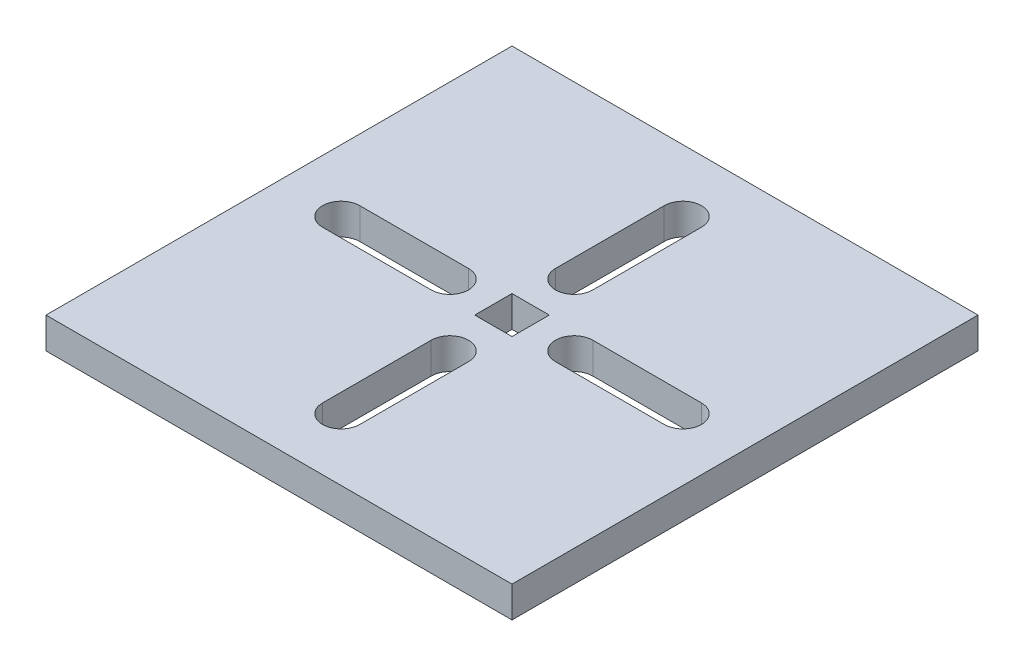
ISO-10303-21;
HEADER;
FILE_DESCRIPTION(('STEP AP214'),'2;1');
FILE_NAME('part.step','',(''),(''),'','','');
FILE_SCHEMA(('AUTOMOTIVE_DESIGN { 1 0 10303 214 1 1 1 1 }'));
ENDSEC;
DATA;
#1=APPLICATION_CONTEXT('core data for automotive mechanical design processes');
#2=APPLICATION_PROTOCOL_DEFINITION('international standard','automotive_design',2000,#1);
#3=PRODUCT_CONTEXT('',#1,'mechanical');
#4=PRODUCT('Part','Part','',(#3));
#5=PRODUCT_RELATED_PRODUCT_CATEGORY('part','',(#4));
#6=PRODUCT_DEFINITION_FORMATION('','',#4);
#7=PRODUCT_DEFINITION_CONTEXT('part definition',#1,'design');
#8=PRODUCT_DEFINITION('design','',#6,#7);
#9=PRODUCT_DEFINITION_SHAPE('','',#8);
#10=(LENGTH_UNIT() NAMED_UNIT(*) SI_UNIT(.MILLI.,.METRE.));
#11=(NAMED_UNIT(*) PLANE_ANGLE_UNIT() SI_UNIT($,.RADIAN.));
#12=(NAMED_UNIT(*) SI_UNIT($,.STERADIAN.) SOLID_ANGLE_UNIT());
#13=UNCERTAINTY_MEASURE_WITH_UNIT(LENGTH_MEASURE(1.E-05),#10,'distance_accuracy_value','');
#14=(GEOMETRIC_REPRESENTATION_CONTEXT(3) GLOBAL_UNCERTAINTY_ASSIGNED_CONTEXT((#13)) GLOBAL_UNIT_ASSIGNED_CONTEXT((#10,
#11,#12)) REPRESENTATION_CONTEXT('',''));
#15=CARTESIAN_POINT('',(0.,0.,0.));
#16=DIRECTION('',(0.,0.,1.));
#17=DIRECTION('',(1.,0.,0.));
#18=AXIS2_PLACEMENT_3D('',#15,#16,#17);
#19=CARTESIAN_POINT('',(75.0000000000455,10.,-75.0000000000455));
#20=DIRECTION('',(-1.,0.,0.));
#21=DIRECTION('',(0.,0.,1.));
#22=AXIS2_PLACEMENT_3D('',#19,#20,#21);
#23=PLANE('',#22);
#24=DIRECTION('',(0.,0.,-1.));
#25=VECTOR('',#24,1.);
#26=CARTESIAN_POINT('',(75.0000000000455,0.,-75.0000000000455));
#27=LINE('',#26,#25);
#28=CARTESIAN_POINT('',(75.0000000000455,0.,75.0000000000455));
#29=VERTEX_POINT('',#28);
#30=CARTESIAN_POINT('',(75.0000000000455,0.,-75.0000000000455));
#31=VERTEX_POINT('',#30);
#32=EDGE_CURVE('E356',#29,#31,#27,.T.);
#33=ORIENTED_EDGE('',*,*,#32,.T.);
#34=DIRECTION('',(0.,-1.,0.));
#35=VECTOR('',#34,1.);
#36=CARTESIAN_POINT('',(75.0000000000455,10.,-75.0000000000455));
#37=LINE('',#36,#35);
#38=CARTESIAN_POINT('',(75.0000000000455,10.,-75.0000000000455));
#39=VERTEX_POINT('',#38);
#40=EDGE_CURVE('E12',#39,#31,#37,.T.);
#41=ORIENTED_EDGE('',*,*,#40,.F.);
#42=DIRECTION('',(0.,0.,-1.));
#43=VECTOR('',#42,1.);
#44=CARTESIAN_POINT('',(75.0000000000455,10.,-75.0000000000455));
#45=LINE('',#44,#43);
#46=CARTESIAN_POINT('',(75.0000000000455,10.,75.0000000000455));
#47=VERTEX_POINT('',#46);
#48=EDGE_CURVE('E363',#47,#39,#45,.T.);
#49=ORIENTED_EDGE('',*,*,#48,.F.);
#50=DIRECTION('',(0.,-1.,0.));
#51=VECTOR('',#50,1.);
#52=CARTESIAN_POINT('',(75.0000000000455,10.,75.0000000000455));
#53=LINE('',#52,#51);
#54=EDGE_CURVE('E373',#47,#29,#53,.T.);
#55=ORIENTED_EDGE('',*,*,#54,.T.);
#56=EDGE_LOOP('',(#33,#41,#49,#55));
#57=FACE_BOUND('',#56,.T.);
#58=ADVANCED_FACE('F37',(#57),#23,.F.);
#59=CARTESIAN_POINT('',(-75.0000000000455,10.,-75.0000000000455));
#60=DIRECTION('',(0.,0.,1.));
#61=DIRECTION('',(1.,0.,0.));
#62=AXIS2_PLACEMENT_3D('',#59,#60,#61);
#63=PLANE('',#62);
#64=DIRECTION('',(-1.,0.,0.));
#65=VECTOR('',#64,1.);
#66=CARTESIAN_POINT('',(-75.0000000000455,0.,-75.0000000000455));
#67=LINE('',#66,#65);
#68=CARTESIAN_POINT('',(-75.0000000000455,0.,-75.0000000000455));
#69=VERTEX_POINT('',#68);
#70=EDGE_CURVE('E376',#31,#69,#67,.T.);
#71=ORIENTED_EDGE('',*,*,#70,.T.);
#72=DIRECTION('',(0.,-1.,0.));
#73=VECTOR('',#72,1.);
#74=CARTESIAN_POINT('',(-75.0000000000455,10.,-75.0000000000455));
#75=LINE('',#74,#73);
#76=CARTESIAN_POINT('',(-75.0000000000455,10.,-75.0000000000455));
#77=VERTEX_POINT('',#76);
#78=EDGE_CURVE('E44',#77,#69,#75,.T.);
#79=ORIENTED_EDGE('',*,*,#78,.F.);
#80=DIRECTION('',(-1.,0.,0.));
#81=VECTOR('',#80,1.);
#82=CARTESIAN_POINT('',(-75.0000000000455,10.,-75.0000000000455));
#83=LINE('',#82,#81);
#84=EDGE_CURVE('E366',#39,#77,#83,.T.);
#85=ORIENTED_EDGE('',*,*,#84,.F.);
#86=ORIENTED_EDGE('',*,*,#40,.T.);
#87=EDGE_LOOP('',(#71,#79,#85,#86));
#88=FACE_BOUND('',#87,.T.);
#89=ADVANCED_FACE('F409',(#88),#63,.F.);
#90=CARTESIAN_POINT('',(-75.0000000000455,10.,-75.0000000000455));
#91=DIRECTION('',(1.,0.,0.));
#92=DIRECTION('',(0.,0.,-1.));
#93=AXIS2_PLACEMENT_3D('',#90,#91,#92);
#94=PLANE('',#93);
#95=DIRECTION('',(0.,0.,1.));
#96=VECTOR('',#95,1.);
#97=CARTESIAN_POINT('',(-75.0000000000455,0.,-75.0000000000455));
#98=LINE('',#97,#96);
#99=CARTESIAN_POINT('',(-75.0000000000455,0.,75.0000000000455));
#100=VERTEX_POINT('',#99);
#101=EDGE_CURVE('E378',#69,#100,#98,.T.);
#102=ORIENTED_EDGE('',*,*,#101,.T.);
#103=DIRECTION('',(0.,-1.,0.));
#104=VECTOR('',#103,1.);
#105=CARTESIAN_POINT('',(-75.0000000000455,10.,75.0000000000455));
#106=LINE('',#105,#104);
#107=CARTESIAN_POINT('',(-75.0000000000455,10.,75.0000000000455));
#108=VERTEX_POINT('',#107);
#109=EDGE_CURVE('E383',#108,#100,#106,.T.);
#110=ORIENTED_EDGE('',*,*,#109,.F.);
#111=DIRECTION('',(0.,0.,1.));
#112=VECTOR('',#111,1.);
#113=CARTESIAN_POINT('',(-75.0000000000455,10.,-75.0000000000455));
#114=LINE('',#113,#112);
#115=EDGE_CURVE('E369',#77,#108,#114,.T.);
#116=ORIENTED_EDGE('',*,*,#115,.F.);
#117=ORIENTED_EDGE('',*,*,#78,.T.);
#118=EDGE_LOOP('',(#102,#110,#116,#117));
#119=FACE_BOUND('',#118,.T.);
#120=ADVANCED_FACE('F394',(#119),#94,.F.);
#121=CARTESIAN_POINT('',(-75.0000000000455,10.,75.0000000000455));
#122=DIRECTION('',(0.,0.,-1.));
#123=DIRECTION('',(-1.,0.,0.));
#124=AXIS2_PLACEMENT_3D('',#121,#122,#123);
#125=PLANE('',#124);
#126=DIRECTION('',(1.,0.,0.));
#127=VECTOR('',#126,1.);
#128=CARTESIAN_POINT('',(-75.0000000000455,0.,75.0000000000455));
#129=LINE('',#128,#127);
#130=EDGE_CURVE('E367',#100,#29,#129,.T.);
#131=ORIENTED_EDGE('',*,*,#130,.T.);
#132=ORIENTED_EDGE('',*,*,#54,.F.);
#133=DIRECTION('',(1.,0.,0.));
#134=VECTOR('',#133,1.);
#135=CARTESIAN_POINT('',(-75.0000000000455,10.,75.0000000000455));
#136=LINE('',#135,#134);
#137=EDGE_CURVE('E371',#108,#47,#136,.T.);
#138=ORIENTED_EDGE('',*,*,#137,.F.);
#139=ORIENTED_EDGE('',*,*,#109,.T.);
#140=EDGE_LOOP('',(#131,#132,#138,#139));
#141=FACE_BOUND('',#140,.T.);
#142=ADVANCED_FACE('F402',(#141),#125,.F.);
#143=CARTESIAN_POINT('',(0.,10.,0.));
#144=DIRECTION('',(0.,1.,0.));
#145=DIRECTION('',(0.,0.,1.));
#146=AXIS2_PLACEMENT_3D('',#143,#144,#145);
#147=PLANE('',#146);
#148=CARTESIAN_POINT('',(2.09488880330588E-13,10.,-20.));
#149=DIRECTION('',(0.,1.,0.));
#150=DIRECTION('',(1.,0.,0.));
#151=AXIS2_PLACEMENT_3D('',#148,#149,#150);
#152=CIRCLE('',#151,6.);
#153=CARTESIAN_POINT('',(-5.99999999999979,10.,-20.0000000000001));
#154=VERTEX_POINT('',#153);
#155=CARTESIAN_POINT('',(6.00000000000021,10.,-19.9999999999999));
#156=VERTEX_POINT('',#155);
#157=EDGE_CURVE('E51',#154,#156,#152,.T.);
#158=ORIENTED_EDGE('',*,*,#157,.F.);
#159=DIRECTION('',(0.,0.,1.));
#160=VECTOR('',#159,1.);
#161=CARTESIAN_POINT('',(-5.99999999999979,10.,-20.0000000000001));
#162=LINE('',#161,#160);
#163=CARTESIAN_POINT('',(-5.99999999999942,10.,-55.0000000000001));
#164=VERTEX_POINT('',#163);
#165=EDGE_CURVE('E215',#164,#154,#162,.T.);
#166=ORIENTED_EDGE('',*,*,#165,.F.);
#167=CARTESIAN_POINT('',(5.76094420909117E-13,10.,-55.));
#168=DIRECTION('',(0.,1.,0.));
#169=DIRECTION('',(1.,0.,0.));
#170=AXIS2_PLACEMENT_3D('',#167,#168,#169);
#171=CIRCLE('',#170,6.);
#172=CARTESIAN_POINT('',(6.00000000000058,10.,-54.9999999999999));
#173=VERTEX_POINT('',#172);
#174=EDGE_CURVE('E218',#173,#164,#171,.T.);
#175=ORIENTED_EDGE('',*,*,#174,.F.);
#176=DIRECTION('',(0.,0.,-1.));
#177=VECTOR('',#176,1.);
#178=CARTESIAN_POINT('',(6.00000000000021,10.,-19.9999999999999));
#179=LINE('',#178,#177);
#180=EDGE_CURVE('E224',#156,#173,#179,.T.);
#181=ORIENTED_EDGE('',*,*,#180,.F.);
#182=EDGE_LOOP('',(#158,#166,#175,#181));
#183=FACE_BOUND('',#182,.T.);
#184=CARTESIAN_POINT('',(-20.,10.,0.));
#185=DIRECTION('',(0.,1.,0.));
#186=DIRECTION('',(0.,0.,-1.));
#187=AXIS2_PLACEMENT_3D('',#184,#185,#186);
#188=CIRCLE('',#187,6.);
#189=CARTESIAN_POINT('',(-20.,10.,6.));
#190=VERTEX_POINT('',#189);
#191=CARTESIAN_POINT('',(-20.,10.,-6.));
#192=VERTEX_POINT('',#191);
#193=EDGE_CURVE('E230',#190,#192,#188,.T.);
#194=ORIENTED_EDGE('',*,*,#193,.F.);
#195=DIRECTION('',(1.,0.,0.));
#196=VECTOR('',#195,1.);
#197=CARTESIAN_POINT('',(-20.,10.,6.));
#198=LINE('',#197,#196);
#199=CARTESIAN_POINT('',(-55.,10.,6.));
#200=VERTEX_POINT('',#199);
#201=EDGE_CURVE('E238',#200,#190,#198,.T.);
#202=ORIENTED_EDGE('',*,*,#201,.F.);
#203=CARTESIAN_POINT('',(-55.,10.,0.));
#204=DIRECTION('',(0.,1.,0.));
#205=DIRECTION('',(0.,0.,-1.));
#206=AXIS2_PLACEMENT_3D('',#203,#204,#205);
#207=CIRCLE('',#206,6.);
#208=CARTESIAN_POINT('',(-55.,10.,-6.));
#209=VERTEX_POINT('',#208);
#210=EDGE_CURVE('E252',#209,#200,#207,.T.);
#211=ORIENTED_EDGE('',*,*,#210,.F.);
#212=DIRECTION('',(-1.,0.,0.));
#213=VECTOR('',#212,1.);
#214=CARTESIAN_POINT('',(-20.,10.,-6.));
#215=LINE('',#214,#213);
#216=EDGE_CURVE('E249',#192,#209,#215,.T.);
#217=ORIENTED_EDGE('',*,*,#216,.F.);
#218=EDGE_LOOP('',(#194,#202,#211,#217));
#219=FACE_BOUND('',#218,.T.);
#220=CARTESIAN_POINT('',(0.,10.,20.));
#221=DIRECTION('',(0.,1.,0.));
#222=DIRECTION('',(-1.,0.,0.));
#223=AXIS2_PLACEMENT_3D('',#220,#221,#222);
#224=CIRCLE('',#223,6.);
#225=CARTESIAN_POINT('',(5.99999999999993,10.,20.));
#226=VERTEX_POINT('',#225);
#227=CARTESIAN_POINT('',(-6.00000000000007,10.,20.));
#228=VERTEX_POINT('',#227);
#229=EDGE_CURVE('E260',#226,#228,#224,.T.);
#230=ORIENTED_EDGE('',*,*,#229,.F.);
#231=DIRECTION('',(0.,0.,-1.));
#232=VECTOR('',#231,1.);
#233=CARTESIAN_POINT('',(5.99999999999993,10.,20.));
#234=LINE('',#233,#232);
#235=CARTESIAN_POINT('',(5.99999999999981,10.,55.));
#236=VERTEX_POINT('',#235);
#237=EDGE_CURVE('E271',#236,#226,#234,.T.);
#238=ORIENTED_EDGE('',*,*,#237,.F.);
#239=CARTESIAN_POINT('',(-1.92031473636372E-13,10.,55.));
#240=DIRECTION('',(0.,1.,0.));
#241=DIRECTION('',(-1.,0.,0.));
#242=AXIS2_PLACEMENT_3D('',#239,#240,#241);
#243=CIRCLE('',#242,6.);
#244=CARTESIAN_POINT('',(-6.00000000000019,10.,55.));
#245=VERTEX_POINT('',#244);
#246=EDGE_CURVE('E285',#245,#236,#243,.T.);
#247=ORIENTED_EDGE('',*,*,#246,.F.);
#248=DIRECTION('',(0.,0.,1.));
#249=VECTOR('',#248,1.);
#250=CARTESIAN_POINT('',(-6.00000000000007,10.,20.));
#251=LINE('',#250,#249);
#252=EDGE_CURVE('E282',#228,#245,#251,.T.);
#253=ORIENTED_EDGE('',*,*,#252,.F.);
#254=EDGE_LOOP('',(#230,#238,#247,#253));
#255=FACE_BOUND('',#254,.T.);
#256=CARTESIAN_POINT('',(20.,10.,0.));
#257=DIRECTION('',(0.,1.,0.));
#258=DIRECTION('',(0.,0.,1.));
#259=AXIS2_PLACEMENT_3D('',#256,#257,#258);
#260=CIRCLE('',#259,6.);
#261=CARTESIAN_POINT('',(20.,10.,-6.));
#262=VERTEX_POINT('',#261);
#263=CARTESIAN_POINT('',(20.,10.,6.));
#264=VERTEX_POINT('',#263);
#265=EDGE_CURVE('E292',#262,#264,#260,.T.);
#266=ORIENTED_EDGE('',*,*,#265,.F.);
#267=DIRECTION('',(-1.,0.,0.));
#268=VECTOR('',#267,1.);
#269=CARTESIAN_POINT('',(20.,10.,-6.));
#270=LINE('',#269,#268);
#271=CARTESIAN_POINT('',(55.,10.,-6.));
#272=VERTEX_POINT('',#271);
#273=EDGE_CURVE('E303',#272,#262,#270,.T.);
#274=ORIENTED_EDGE('',*,*,#273,.F.);
#275=CARTESIAN_POINT('',(55.,10.,0.));
#276=DIRECTION('',(0.,1.,0.));
#277=DIRECTION('',(0.,0.,1.));
#278=AXIS2_PLACEMENT_3D('',#275,#276,#277);
#279=CIRCLE('',#278,6.);
#280=CARTESIAN_POINT('',(55.,10.,6.));
#281=VERTEX_POINT('',#280);
#282=EDGE_CURVE('E317',#281,#272,#279,.T.);
#283=ORIENTED_EDGE('',*,*,#282,.F.);
#284=DIRECTION('',(1.,0.,0.));
#285=VECTOR('',#284,1.);
#286=CARTESIAN_POINT('',(20.,10.,6.));
#287=LINE('',#286,#285);
#288=EDGE_CURVE('E314',#264,#281,#287,.T.);
#289=ORIENTED_EDGE('',*,*,#288,.F.);
#290=EDGE_LOOP('',(#266,#274,#283,#289));
#291=FACE_BOUND('',#290,.T.);
#292=DIRECTION('',(0.,0.,-1.));
#293=VECTOR('',#292,1.);
#294=CARTESIAN_POINT('',(6.,10.,-6.));
#295=LINE('',#294,#293);
#296=CARTESIAN_POINT('',(6.,10.,6.));
#297=VERTEX_POINT('',#296);
#298=CARTESIAN_POINT('',(6.,10.,-6.));
#299=VERTEX_POINT('',#298);
#300=EDGE_CURVE('E324',#297,#299,#295,.T.);
#301=ORIENTED_EDGE('',*,*,#300,.F.);
#302=DIRECTION('',(1.,0.,0.));
#303=VECTOR('',#302,1.);
#304=CARTESIAN_POINT('',(-6.,10.,6.));
#305=LINE('',#304,#303);
#306=CARTESIAN_POINT('',(-6.,10.,6.));
#307=VERTEX_POINT('',#306);
#308=EDGE_CURVE('E335',#307,#297,#305,.T.);
#309=ORIENTED_EDGE('',*,*,#308,.F.);
#310=DIRECTION('',(0.,0.,1.));
#311=VECTOR('',#310,1.);
#312=CARTESIAN_POINT('',(-6.,10.,-6.));
#313=LINE('',#312,#311);
#314=CARTESIAN_POINT('',(-6.,10.,-6.));
#315=VERTEX_POINT('',#314);
#316=EDGE_CURVE('E349',#315,#307,#313,.T.);
#317=ORIENTED_EDGE('',*,*,#316,.F.);
#318=DIRECTION('',(-1.,0.,0.));
#319=VECTOR('',#318,1.);
#320=CARTESIAN_POINT('',(-6.,10.,-6.));
#321=LINE('',#320,#319);
#322=EDGE_CURVE('E346',#299,#315,#321,.T.);
#323=ORIENTED_EDGE('',*,*,#322,.F.);
#324=EDGE_LOOP('',(#301,#309,#317,#323));
#325=FACE_BOUND('',#324,.T.);
#326=ORIENTED_EDGE('',*,*,#48,.T.);
#327=ORIENTED_EDGE('',*,*,#84,.T.);
#328=ORIENTED_EDGE('',*,*,#115,.T.);
#329=ORIENTED_EDGE('',*,*,#137,.T.);
#330=EDGE_LOOP('',(#326,#327,#328,#329));
#331=FACE_BOUND('',#330,.T.);
#332=ADVANCED_FACE('F408',(#183,#219,#255,#291,#325,#331),#147,.T.);
#333=CARTESIAN_POINT('',(0.,0.,0.));
#334=DIRECTION('',(0.,1.,0.));
#335=DIRECTION('',(0.,0.,1.));
#336=AXIS2_PLACEMENT_3D('',#333,#334,#335);
#337=PLANE('',#336);
#338=DIRECTION('',(0.,0.,1.));
#339=VECTOR('',#338,1.);
#340=CARTESIAN_POINT('',(-5.99999999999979,0.,-20.0000000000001));
#341=LINE('',#340,#339);
#342=CARTESIAN_POINT('',(-5.99999999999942,0.,-55.0000000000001));
#343=VERTEX_POINT('',#342);
#344=CARTESIAN_POINT('',(-5.99999999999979,0.,-20.0000000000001));
#345=VERTEX_POINT('',#344);
#346=EDGE_CURVE('E205',#343,#345,#341,.T.);
#347=ORIENTED_EDGE('',*,*,#346,.T.);
#348=CARTESIAN_POINT('',(2.09488880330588E-13,0.,-20.));
#349=DIRECTION('',(0.,1.,0.));
#350=DIRECTION('',(1.,0.,0.));
#351=AXIS2_PLACEMENT_3D('',#348,#349,#350);
#352=CIRCLE('',#351,6.);
#353=CARTESIAN_POINT('',(6.00000000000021,0.,-19.9999999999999));
#354=VERTEX_POINT('',#353);
#355=EDGE_CURVE('E199',#345,#354,#352,.T.);
#356=ORIENTED_EDGE('',*,*,#355,.T.);
#357=DIRECTION('',(0.,0.,-1.));
#358=VECTOR('',#357,1.);
#359=CARTESIAN_POINT('',(6.00000000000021,0.,-19.9999999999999));
#360=LINE('',#359,#358);
#361=CARTESIAN_POINT('',(6.00000000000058,0.,-54.9999999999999));
#362=VERTEX_POINT('',#361);
#363=EDGE_CURVE('E208',#354,#362,#360,.T.);
#364=ORIENTED_EDGE('',*,*,#363,.T.);
#365=CARTESIAN_POINT('',(5.76094420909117E-13,0.,-55.));
#366=DIRECTION('',(0.,1.,0.));
#367=DIRECTION('',(1.,0.,0.));
#368=AXIS2_PLACEMENT_3D('',#365,#366,#367);
#369=CIRCLE('',#368,6.);
#370=EDGE_CURVE('E59',#362,#343,#369,.T.);
#371=ORIENTED_EDGE('',*,*,#370,.T.);
#372=EDGE_LOOP('',(#347,#356,#364,#371));
#373=FACE_BOUND('',#372,.T.);
#374=DIRECTION('',(1.,0.,0.));
#375=VECTOR('',#374,1.);
#376=CARTESIAN_POINT('',(-20.,0.,6.));
#377=LINE('',#376,#375);
#378=CARTESIAN_POINT('',(-55.,0.,6.));
#379=VERTEX_POINT('',#378);
#380=CARTESIAN_POINT('',(-20.,0.,6.));
#381=VERTEX_POINT('',#380);
#382=EDGE_CURVE('E244',#379,#381,#377,.T.);
#383=ORIENTED_EDGE('',*,*,#382,.T.);
#384=CARTESIAN_POINT('',(-20.,0.,0.));
#385=DIRECTION('',(0.,1.,0.));
#386=DIRECTION('',(0.,0.,-1.));
#387=AXIS2_PLACEMENT_3D('',#384,#385,#386);
#388=CIRCLE('',#387,6.);
#389=CARTESIAN_POINT('',(-20.,0.,-6.));
#390=VERTEX_POINT('',#389);
#391=EDGE_CURVE('E234',#381,#390,#388,.T.);
#392=ORIENTED_EDGE('',*,*,#391,.T.);
#393=DIRECTION('',(-1.,0.,0.));
#394=VECTOR('',#393,1.);
#395=CARTESIAN_POINT('',(-20.,0.,-6.));
#396=LINE('',#395,#394);
#397=CARTESIAN_POINT('',(-55.,0.,-6.));
#398=VERTEX_POINT('',#397);
#399=EDGE_CURVE('E237',#390,#398,#396,.T.);
#400=ORIENTED_EDGE('',*,*,#399,.T.);
#401=CARTESIAN_POINT('',(-55.,0.,0.));
#402=DIRECTION('',(0.,1.,0.));
#403=DIRECTION('',(0.,0.,-1.));
#404=AXIS2_PLACEMENT_3D('',#401,#402,#403);
#405=CIRCLE('',#404,6.);
#406=EDGE_CURVE('E241',#398,#379,#405,.T.);
#407=ORIENTED_EDGE('',*,*,#406,.T.);
#408=EDGE_LOOP('',(#383,#392,#400,#407));
#409=FACE_BOUND('',#408,.T.);
#410=DIRECTION('',(0.,0.,-1.));
#411=VECTOR('',#410,1.);
#412=CARTESIAN_POINT('',(5.99999999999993,0.,20.));
#413=LINE('',#412,#411);
#414=CARTESIAN_POINT('',(5.99999999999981,0.,55.));
#415=VERTEX_POINT('',#414);
#416=CARTESIAN_POINT('',(5.99999999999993,0.,20.));
#417=VERTEX_POINT('',#416);
#418=EDGE_CURVE('E277',#415,#417,#413,.T.);
#419=ORIENTED_EDGE('',*,*,#418,.T.);
#420=CARTESIAN_POINT('',(0.,0.,20.));
#421=DIRECTION('',(0.,1.,0.));
#422=DIRECTION('',(-1.,0.,0.));
#423=AXIS2_PLACEMENT_3D('',#420,#421,#422);
#424=CIRCLE('',#423,6.);
#425=CARTESIAN_POINT('',(-6.00000000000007,0.,20.));
#426=VERTEX_POINT('',#425);
#427=EDGE_CURVE('E267',#417,#426,#424,.T.);
#428=ORIENTED_EDGE('',*,*,#427,.T.);
#429=DIRECTION('',(0.,0.,1.));
#430=VECTOR('',#429,1.);
#431=CARTESIAN_POINT('',(-6.00000000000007,0.,20.));
#432=LINE('',#431,#430);
#433=CARTESIAN_POINT('',(-6.00000000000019,0.,55.));
#434=VERTEX_POINT('',#433);
#435=EDGE_CURVE('E270',#426,#434,#432,.T.);
#436=ORIENTED_EDGE('',*,*,#435,.T.);
#437=CARTESIAN_POINT('',(-1.92031473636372E-13,0.,55.));
#438=DIRECTION('',(0.,1.,0.));
#439=DIRECTION('',(-1.,0.,0.));
#440=AXIS2_PLACEMENT_3D('',#437,#438,#439);
#441=CIRCLE('',#440,6.);
#442=EDGE_CURVE('E274',#434,#415,#441,.T.);
#443=ORIENTED_EDGE('',*,*,#442,.T.);
#444=EDGE_LOOP('',(#419,#428,#436,#443));
#445=FACE_BOUND('',#444,.T.);
#446=DIRECTION('',(-1.,0.,0.));
#447=VECTOR('',#446,1.);
#448=CARTESIAN_POINT('',(20.,0.,-6.));
#449=LINE('',#448,#447);
#450=CARTESIAN_POINT('',(55.,0.,-6.));
#451=VERTEX_POINT('',#450);
#452=CARTESIAN_POINT('',(20.,0.,-6.));
#453=VERTEX_POINT('',#452);
#454=EDGE_CURVE('E309',#451,#453,#449,.T.);
#455=ORIENTED_EDGE('',*,*,#454,.T.);
#456=CARTESIAN_POINT('',(20.,0.,0.));
#457=DIRECTION('',(0.,1.,0.));
#458=DIRECTION('',(0.,0.,1.));
#459=AXIS2_PLACEMENT_3D('',#456,#457,#458);
#460=CIRCLE('',#459,6.);
#461=CARTESIAN_POINT('',(20.,0.,6.));
#462=VERTEX_POINT('',#461);
#463=EDGE_CURVE('E299',#453,#462,#460,.T.);
#464=ORIENTED_EDGE('',*,*,#463,.T.);
#465=DIRECTION('',(1.,0.,0.));
#466=VECTOR('',#465,1.);
#467=CARTESIAN_POINT('',(20.,0.,6.));
#468=LINE('',#467,#466);
#469=CARTESIAN_POINT('',(55.,0.,6.));
#470=VERTEX_POINT('',#469);
#471=EDGE_CURVE('E302',#462,#470,#468,.T.);
#472=ORIENTED_EDGE('',*,*,#471,.T.);
#473=CARTESIAN_POINT('',(55.,0.,0.));
#474=DIRECTION('',(0.,1.,0.));
#475=DIRECTION('',(0.,0.,1.));
#476=AXIS2_PLACEMENT_3D('',#473,#474,#475);
#477=CIRCLE('',#476,6.);
#478=EDGE_CURVE('E306',#470,#451,#477,.T.);
#479=ORIENTED_EDGE('',*,*,#478,.T.);
#480=EDGE_LOOP('',(#455,#464,#472,#479));
#481=FACE_BOUND('',#480,.T.);
#482=DIRECTION('',(1.,0.,0.));
#483=VECTOR('',#482,1.);
#484=CARTESIAN_POINT('',(-6.,0.,6.));
#485=LINE('',#484,#483);
#486=CARTESIAN_POINT('',(-6.,0.,6.));
#487=VERTEX_POINT('',#486);
#488=CARTESIAN_POINT('',(6.,0.,6.));
#489=VERTEX_POINT('',#488);
#490=EDGE_CURVE('E341',#487,#489,#485,.T.);
#491=ORIENTED_EDGE('',*,*,#490,.T.);
#492=DIRECTION('',(0.,0.,-1.));
#493=VECTOR('',#492,1.);
#494=CARTESIAN_POINT('',(6.,0.,-6.));
#495=LINE('',#494,#493);
#496=CARTESIAN_POINT('',(6.,0.,-6.));
#497=VERTEX_POINT('',#496);
#498=EDGE_CURVE('E331',#489,#497,#495,.T.);
#499=ORIENTED_EDGE('',*,*,#498,.T.);
#500=DIRECTION('',(-1.,0.,0.));
#501=VECTOR('',#500,1.);
#502=CARTESIAN_POINT('',(-6.,0.,-6.));
#503=LINE('',#502,#501);
#504=CARTESIAN_POINT('',(-6.,0.,-6.));
#505=VERTEX_POINT('',#504);
#506=EDGE_CURVE('E334',#497,#505,#503,.T.);
#507=ORIENTED_EDGE('',*,*,#506,.T.);
#508=DIRECTION('',(0.,0.,1.));
#509=VECTOR('',#508,1.);
#510=CARTESIAN_POINT('',(-6.,0.,-6.));
#511=LINE('',#510,#509);
#512=EDGE_CURVE('E338',#505,#487,#511,.T.);
#513=ORIENTED_EDGE('',*,*,#512,.T.);
#514=EDGE_LOOP('',(#491,#499,#507,#513));
#515=FACE_BOUND('',#514,.T.);
#516=ORIENTED_EDGE('',*,*,#32,.F.);
#517=ORIENTED_EDGE('',*,*,#130,.F.);
#518=ORIENTED_EDGE('',*,*,#101,.F.);
#519=ORIENTED_EDGE('',*,*,#70,.F.);
#520=EDGE_LOOP('',(#516,#517,#518,#519));
#521=FACE_BOUND('',#520,.T.);
#522=ADVANCED_FACE('F212',(#373,#409,#445,#481,#515,#521),#337,.F.);
#523=CARTESIAN_POINT('',(6.,0.,-6.));
#524=DIRECTION('',(1.,0.,0.));
#525=DIRECTION('',(0.,0.,-1.));
#526=AXIS2_PLACEMENT_3D('',#523,#524,#525);
#527=PLANE('',#526);
#528=ORIENTED_EDGE('',*,*,#300,.T.);
#529=DIRECTION('',(0.,1.,0.));
#530=VECTOR('',#529,1.);
#531=CARTESIAN_POINT('',(6.,0.,-6.));
#532=LINE('',#531,#530);
#533=EDGE_CURVE('E344',#497,#299,#532,.T.);
#534=ORIENTED_EDGE('',*,*,#533,.F.);
#535=ORIENTED_EDGE('',*,*,#498,.F.);
#536=DIRECTION('',(0.,1.,0.));
#537=VECTOR('',#536,1.);
#538=CARTESIAN_POINT('',(6.,0.,6.));
#539=LINE('',#538,#537);
#540=EDGE_CURVE('E354',#489,#297,#539,.T.);
#541=ORIENTED_EDGE('',*,*,#540,.T.);
#542=EDGE_LOOP('',(#528,#534,#535,#541));
#543=FACE_BOUND('',#542,.T.);
#544=ADVANCED_FACE('F421',(#543),#527,.F.);
#545=CARTESIAN_POINT('',(-6.,0.,6.));
#546=DIRECTION('',(0.,0.,1.));
#547=DIRECTION('',(1.,0.,0.));
#548=AXIS2_PLACEMENT_3D('',#545,#546,#547);
#549=PLANE('',#548);
#550=ORIENTED_EDGE('',*,*,#308,.T.);
#551=ORIENTED_EDGE('',*,*,#540,.F.);
#552=ORIENTED_EDGE('',*,*,#490,.F.);
#553=DIRECTION('',(0.,1.,0.));
#554=VECTOR('',#553,1.);
#555=CARTESIAN_POINT('',(-6.,0.,6.));
#556=LINE('',#555,#554);
#557=EDGE_CURVE('E357',#487,#307,#556,.T.);
#558=ORIENTED_EDGE('',*,*,#557,.T.);
#559=EDGE_LOOP('',(#550,#551,#552,#558));
#560=FACE_BOUND('',#559,.T.);
#561=ADVANCED_FACE('F427',(#560),#549,.F.);
#562=CARTESIAN_POINT('',(-6.,0.,-6.));
#563=DIRECTION('',(-1.,0.,0.));
#564=DIRECTION('',(0.,0.,1.));
#565=AXIS2_PLACEMENT_3D('',#562,#563,#564);
#566=PLANE('',#565);
#567=ORIENTED_EDGE('',*,*,#316,.T.);
#568=ORIENTED_EDGE('',*,*,#557,.F.);
#569=ORIENTED_EDGE('',*,*,#512,.F.);
#570=DIRECTION('',(0.,1.,0.));
#571=VECTOR('',#570,1.);
#572=CARTESIAN_POINT('',(-6.,0.,-6.));
#573=LINE('',#572,#571);
#574=EDGE_CURVE('E359',#505,#315,#573,.T.);
#575=ORIENTED_EDGE('',*,*,#574,.T.);
#576=EDGE_LOOP('',(#567,#568,#569,#575));
#577=FACE_BOUND('',#576,.T.);
#578=ADVANCED_FACE('F433',(#577),#566,.F.);
#579=CARTESIAN_POINT('',(-6.,0.,-6.));
#580=DIRECTION('',(0.,0.,-1.));
#581=DIRECTION('',(-1.,0.,0.));
#582=AXIS2_PLACEMENT_3D('',#579,#580,#581);
#583=PLANE('',#582);
#584=ORIENTED_EDGE('',*,*,#322,.T.);
#585=ORIENTED_EDGE('',*,*,#574,.F.);
#586=ORIENTED_EDGE('',*,*,#506,.F.);
#587=ORIENTED_EDGE('',*,*,#533,.T.);
#588=EDGE_LOOP('',(#584,#585,#586,#587));
#589=FACE_BOUND('',#588,.T.);
#590=ADVANCED_FACE('F429',(#589),#583,.F.);
#591=CARTESIAN_POINT('',(20.,0.,0.));
#592=DIRECTION('',(0.,1.,0.));
#593=DIRECTION('',(0.,0.,1.));
#594=AXIS2_PLACEMENT_3D('',#591,#592,#593);
#595=CYLINDRICAL_SURFACE('',#594,6.);
#596=ORIENTED_EDGE('',*,*,#265,.T.);
#597=DIRECTION('',(0.,1.,0.));
#598=VECTOR('',#597,1.);
#599=CARTESIAN_POINT('',(20.,0.,6.));
#600=LINE('',#599,#598);
#601=EDGE_CURVE('E312',#462,#264,#600,.T.);
#602=ORIENTED_EDGE('',*,*,#601,.F.);
#603=ORIENTED_EDGE('',*,*,#463,.F.);
#604=DIRECTION('',(0.,1.,0.));
#605=VECTOR('',#604,1.);
#606=CARTESIAN_POINT('',(20.,0.,-6.));
#607=LINE('',#606,#605);
#608=EDGE_CURVE('E322',#453,#262,#607,.T.);
#609=ORIENTED_EDGE('',*,*,#608,.T.);
#610=EDGE_LOOP('',(#596,#602,#603,#609));
#611=FACE_BOUND('',#610,.T.);
#612=ADVANCED_FACE('F432',(#611),#595,.F.);
#613=CARTESIAN_POINT('',(20.,0.,-6.));
#614=DIRECTION('',(0.,0.,-1.));
#615=DIRECTION('',(-1.,0.,0.));
#616=AXIS2_PLACEMENT_3D('',#613,#614,#615);
#617=PLANE('',#616);
#618=ORIENTED_EDGE('',*,*,#273,.T.);
#619=ORIENTED_EDGE('',*,*,#608,.F.);
#620=ORIENTED_EDGE('',*,*,#454,.F.);
#621=DIRECTION('',(0.,1.,0.));
#622=VECTOR('',#621,1.);
#623=CARTESIAN_POINT('',(55.,0.,-6.));
#624=LINE('',#623,#622);
#625=EDGE_CURVE('E325',#451,#272,#624,.T.);
#626=ORIENTED_EDGE('',*,*,#625,.T.);
#627=EDGE_LOOP('',(#618,#619,#620,#626));
#628=FACE_BOUND('',#627,.T.);
#629=ADVANCED_FACE('F443',(#628),#617,.F.);
#630=CARTESIAN_POINT('',(55.,0.,0.));
#631=DIRECTION('',(0.,1.,0.));
#632=DIRECTION('',(0.,0.,1.));
#633=AXIS2_PLACEMENT_3D('',#630,#631,#632);
#634=CYLINDRICAL_SURFACE('',#633,6.);
#635=ORIENTED_EDGE('',*,*,#282,.T.);
#636=ORIENTED_EDGE('',*,*,#625,.F.);
#637=ORIENTED_EDGE('',*,*,#478,.F.);
#638=DIRECTION('',(0.,1.,0.));
#639=VECTOR('',#638,1.);
#640=CARTESIAN_POINT('',(55.,0.,6.));
#641=LINE('',#640,#639);
#642=EDGE_CURVE('E327',#470,#281,#641,.T.);
#643=ORIENTED_EDGE('',*,*,#642,.T.);
#644=EDGE_LOOP('',(#635,#636,#637,#643));
#645=FACE_BOUND('',#644,.T.);
#646=ADVANCED_FACE('F449',(#645),#634,.F.);
#647=CARTESIAN_POINT('',(20.,0.,6.));
#648=DIRECTION('',(0.,0.,1.));
#649=DIRECTION('',(1.,0.,0.));
#650=AXIS2_PLACEMENT_3D('',#647,#648,#649);
#651=PLANE('',#650);
#652=ORIENTED_EDGE('',*,*,#288,.T.);
#653=ORIENTED_EDGE('',*,*,#642,.F.);
#654=ORIENTED_EDGE('',*,*,#471,.F.);
#655=ORIENTED_EDGE('',*,*,#601,.T.);
#656=EDGE_LOOP('',(#652,#653,#654,#655));
#657=FACE_BOUND('',#656,.T.);
#658=ADVANCED_FACE('F445',(#657),#651,.F.);
#659=CARTESIAN_POINT('',(0.,0.,20.));
#660=DIRECTION('',(0.,1.,0.));
#661=DIRECTION('',(0.,0.,1.));
#662=AXIS2_PLACEMENT_3D('',#659,#660,#661);
#663=CYLINDRICAL_SURFACE('',#662,6.);
#664=ORIENTED_EDGE('',*,*,#229,.T.);
#665=DIRECTION('',(0.,1.,0.));
#666=VECTOR('',#665,1.);
#667=CARTESIAN_POINT('',(-6.00000000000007,0.,20.));
#668=LINE('',#667,#666);
#669=EDGE_CURVE('E280',#426,#228,#668,.T.);
#670=ORIENTED_EDGE('',*,*,#669,.F.);
#671=ORIENTED_EDGE('',*,*,#427,.F.);
#672=DIRECTION('',(0.,1.,0.));
#673=VECTOR('',#672,1.);
#674=CARTESIAN_POINT('',(5.99999999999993,0.,20.));
#675=LINE('',#674,#673);
#676=EDGE_CURVE('E290',#417,#226,#675,.T.);
#677=ORIENTED_EDGE('',*,*,#676,.T.);
#678=EDGE_LOOP('',(#664,#670,#671,#677));
#679=FACE_BOUND('',#678,.T.);
#680=ADVANCED_FACE('F448',(#679),#663,.F.);
#681=CARTESIAN_POINT('',(5.99999999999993,0.,20.));
#682=DIRECTION('',(1.,0.,0.));
#683=DIRECTION('',(0.,0.,-1.));
#684=AXIS2_PLACEMENT_3D('',#681,#682,#683);
#685=PLANE('',#684);
#686=ORIENTED_EDGE('',*,*,#237,.T.);
#687=ORIENTED_EDGE('',*,*,#676,.F.);
#688=ORIENTED_EDGE('',*,*,#418,.F.);
#689=DIRECTION('',(0.,1.,0.));
#690=VECTOR('',#689,1.);
#691=CARTESIAN_POINT('',(5.99999999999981,0.,55.));
#692=LINE('',#691,#690);
#693=EDGE_CURVE('E293',#415,#236,#692,.T.);
#694=ORIENTED_EDGE('',*,*,#693,.T.);
#695=EDGE_LOOP('',(#686,#687,#688,#694));
#696=FACE_BOUND('',#695,.T.);
#697=ADVANCED_FACE('F459',(#696),#685,.F.);
#698=CARTESIAN_POINT('',(-1.92031473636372E-13,0.,55.));
#699=DIRECTION('',(0.,1.,0.));
#700=DIRECTION('',(0.,0.,1.));
#701=AXIS2_PLACEMENT_3D('',#698,#699,#700);
#702=CYLINDRICAL_SURFACE('',#701,6.);
#703=ORIENTED_EDGE('',*,*,#246,.T.);
#704=ORIENTED_EDGE('',*,*,#693,.F.);
#705=ORIENTED_EDGE('',*,*,#442,.F.);
#706=DIRECTION('',(0.,1.,0.));
#707=VECTOR('',#706,1.);
#708=CARTESIAN_POINT('',(-6.00000000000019,0.,55.));
#709=LINE('',#708,#707);
#710=EDGE_CURVE('E295',#434,#245,#709,.T.);
#711=ORIENTED_EDGE('',*,*,#710,.T.);
#712=EDGE_LOOP('',(#703,#704,#705,#711));
#713=FACE_BOUND('',#712,.T.);
#714=ADVANCED_FACE('F465',(#713),#702,.F.);
#715=CARTESIAN_POINT('',(-6.00000000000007,0.,20.));
#716=DIRECTION('',(-1.,0.,0.));
#717=DIRECTION('',(0.,0.,1.));
#718=AXIS2_PLACEMENT_3D('',#715,#716,#717);
#719=PLANE('',#718);
#720=ORIENTED_EDGE('',*,*,#252,.T.);
#721=ORIENTED_EDGE('',*,*,#710,.F.);
#722=ORIENTED_EDGE('',*,*,#435,.F.);
#723=ORIENTED_EDGE('',*,*,#669,.T.);
#724=EDGE_LOOP('',(#720,#721,#722,#723));
#725=FACE_BOUND('',#724,.T.);
#726=ADVANCED_FACE('F461',(#725),#719,.F.);
#727=CARTESIAN_POINT('',(-20.,0.,0.));
#728=DIRECTION('',(0.,1.,0.));
#729=DIRECTION('',(0.,0.,1.));
#730=AXIS2_PLACEMENT_3D('',#727,#728,#729);
#731=CYLINDRICAL_SURFACE('',#730,6.);
#732=ORIENTED_EDGE('',*,*,#193,.T.);
#733=DIRECTION('',(0.,1.,0.));
#734=VECTOR('',#733,1.);
#735=CARTESIAN_POINT('',(-20.,0.,-6.));
#736=LINE('',#735,#734);
#737=EDGE_CURVE('E247',#390,#192,#736,.T.);
#738=ORIENTED_EDGE('',*,*,#737,.F.);
#739=ORIENTED_EDGE('',*,*,#391,.F.);
#740=DIRECTION('',(0.,1.,0.));
#741=VECTOR('',#740,1.);
#742=CARTESIAN_POINT('',(-20.,0.,6.));
#743=LINE('',#742,#741);
#744=EDGE_CURVE('E258',#381,#190,#743,.T.);
#745=ORIENTED_EDGE('',*,*,#744,.T.);
#746=EDGE_LOOP('',(#732,#738,#739,#745));
#747=FACE_BOUND('',#746,.T.);
#748=ADVANCED_FACE('F464',(#747),#731,.F.);
#749=CARTESIAN_POINT('',(-20.,0.,6.));
#750=DIRECTION('',(0.,0.,1.));
#751=DIRECTION('',(1.,0.,0.));
#752=AXIS2_PLACEMENT_3D('',#749,#750,#751);
#753=PLANE('',#752);
#754=ORIENTED_EDGE('',*,*,#201,.T.);
#755=ORIENTED_EDGE('',*,*,#744,.F.);
#756=ORIENTED_EDGE('',*,*,#382,.F.);
#757=DIRECTION('',(0.,1.,0.));
#758=VECTOR('',#757,1.);
#759=CARTESIAN_POINT('',(-55.,0.,6.));
#760=LINE('',#759,#758);
#761=EDGE_CURVE('E261',#379,#200,#760,.T.);
#762=ORIENTED_EDGE('',*,*,#761,.T.);
#763=EDGE_LOOP('',(#754,#755,#756,#762));
#764=FACE_BOUND('',#763,.T.);
#765=ADVANCED_FACE('F475',(#764),#753,.F.);
#766=CARTESIAN_POINT('',(-55.,0.,0.));
#767=DIRECTION('',(0.,1.,0.));
#768=DIRECTION('',(0.,0.,1.));
#769=AXIS2_PLACEMENT_3D('',#766,#767,#768);
#770=CYLINDRICAL_SURFACE('',#769,6.);
#771=ORIENTED_EDGE('',*,*,#210,.T.);
#772=ORIENTED_EDGE('',*,*,#761,.F.);
#773=ORIENTED_EDGE('',*,*,#406,.F.);
#774=DIRECTION('',(0.,1.,0.));
#775=VECTOR('',#774,1.);
#776=CARTESIAN_POINT('',(-55.,0.,-6.));
#777=LINE('',#776,#775);
#778=EDGE_CURVE('E263',#398,#209,#777,.T.);
#779=ORIENTED_EDGE('',*,*,#778,.T.);
#780=EDGE_LOOP('',(#771,#772,#773,#779));
#781=FACE_BOUND('',#780,.T.);
#782=ADVANCED_FACE('F480',(#781),#770,.F.);
#783=CARTESIAN_POINT('',(-20.,0.,-6.));
#784=DIRECTION('',(0.,0.,-1.));
#785=DIRECTION('',(-1.,0.,0.));
#786=AXIS2_PLACEMENT_3D('',#783,#784,#785);
#787=PLANE('',#786);
#788=ORIENTED_EDGE('',*,*,#216,.T.);
#789=ORIENTED_EDGE('',*,*,#778,.F.);
#790=ORIENTED_EDGE('',*,*,#399,.F.);
#791=ORIENTED_EDGE('',*,*,#737,.T.);
#792=EDGE_LOOP('',(#788,#789,#790,#791));
#793=FACE_BOUND('',#792,.T.);
#794=ADVANCED_FACE('F477',(#793),#787,.F.);
#795=CARTESIAN_POINT('',(2.09488880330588E-13,0.,-20.));
#796=DIRECTION('',(0.,1.,0.));
#797=DIRECTION('',(0.,0.,1.));
#798=AXIS2_PLACEMENT_3D('',#795,#796,#797);
#799=CYLINDRICAL_SURFACE('',#798,6.);
#800=ORIENTED_EDGE('',*,*,#157,.T.);
#801=DIRECTION('',(0.,1.,0.));
#802=VECTOR('',#801,1.);
#803=CARTESIAN_POINT('',(6.00000000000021,0.,-19.9999999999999));
#804=LINE('',#803,#802);
#805=EDGE_CURVE('E195',#354,#156,#804,.T.);
#806=ORIENTED_EDGE('',*,*,#805,.F.);
#807=ORIENTED_EDGE('',*,*,#355,.F.);
#808=DIRECTION('',(0.,1.,0.));
#809=VECTOR('',#808,1.);
#810=CARTESIAN_POINT('',(-5.99999999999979,0.,-20.0000000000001));
#811=LINE('',#810,#809);
#812=EDGE_CURVE('E228',#345,#154,#811,.T.);
#813=ORIENTED_EDGE('',*,*,#812,.T.);
#814=EDGE_LOOP('',(#800,#806,#807,#813));
#815=FACE_BOUND('',#814,.T.);
#816=ADVANCED_FACE('F197',(#815),#799,.F.);
#817=CARTESIAN_POINT('',(-5.99999999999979,0.,-20.0000000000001));
#818=DIRECTION('',(-1.,0.,0.));
#819=DIRECTION('',(0.,0.,1.));
#820=AXIS2_PLACEMENT_3D('',#817,#818,#819);
#821=PLANE('',#820);
#822=ORIENTED_EDGE('',*,*,#165,.T.);
#823=ORIENTED_EDGE('',*,*,#812,.F.);
#824=ORIENTED_EDGE('',*,*,#346,.F.);
#825=DIRECTION('',(0.,1.,0.));
#826=VECTOR('',#825,1.);
#827=CARTESIAN_POINT('',(-5.99999999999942,0.,-55.0000000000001));
#828=LINE('',#827,#826);
#829=EDGE_CURVE('E231',#343,#164,#828,.T.);
#830=ORIENTED_EDGE('',*,*,#829,.T.);
#831=EDGE_LOOP('',(#822,#823,#824,#830));
#832=FACE_BOUND('',#831,.T.);
#833=ADVANCED_FACE('F490',(#832),#821,.F.);
#834=CARTESIAN_POINT('',(5.76094420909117E-13,0.,-55.));
#835=DIRECTION('',(0.,1.,0.));
#836=DIRECTION('',(0.,0.,1.));
#837=AXIS2_PLACEMENT_3D('',#834,#835,#836);
#838=CYLINDRICAL_SURFACE('',#837,6.);
#839=ORIENTED_EDGE('',*,*,#174,.T.);
#840=ORIENTED_EDGE('',*,*,#829,.F.);
#841=ORIENTED_EDGE('',*,*,#370,.F.);
#842=DIRECTION('',(0.,1.,0.));
#843=VECTOR('',#842,1.);
#844=CARTESIAN_POINT('',(6.00000000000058,0.,-54.9999999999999));
#845=LINE('',#844,#843);
#846=EDGE_CURVE('E204',#362,#173,#845,.T.);
#847=ORIENTED_EDGE('',*,*,#846,.T.);
#848=EDGE_LOOP('',(#839,#840,#841,#847));
#849=FACE_BOUND('',#848,.T.);
#850=ADVANCED_FACE('F493',(#849),#838,.F.);
#851=CARTESIAN_POINT('',(6.00000000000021,0.,-19.9999999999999));
#852=DIRECTION('',(1.,0.,0.));
#853=DIRECTION('',(0.,0.,-1.));
#854=AXIS2_PLACEMENT_3D('',#851,#852,#853);
#855=PLANE('',#854);
#856=ORIENTED_EDGE('',*,*,#180,.T.);
#857=ORIENTED_EDGE('',*,*,#846,.F.);
#858=ORIENTED_EDGE('',*,*,#363,.F.);
#859=ORIENTED_EDGE('',*,*,#805,.T.);
#860=EDGE_LOOP('',(#856,#857,#858,#859));
#861=FACE_BOUND('',#860,.T.);
#862=ADVANCED_FACE('F209',(#861),#855,.F.);
#863=CLOSED_SHELL('',(#58,#89,#120,#142,#332,#522,#544,#561,#578,#590,#612,#629,#646,#658,#680,
#697,#714,#726,#748,#765,#782,#794,#816,#833,#850,#862));
#864=MANIFOLD_SOLID_BREP('B2',#863);
#865=ADVANCED_BREP_SHAPE_REPRESENTATION('',(#18,#864),#14);
#866=SHAPE_DEFINITION_REPRESENTATION(#9,#865);
ENDSEC;
END-ISO-10303-21;
